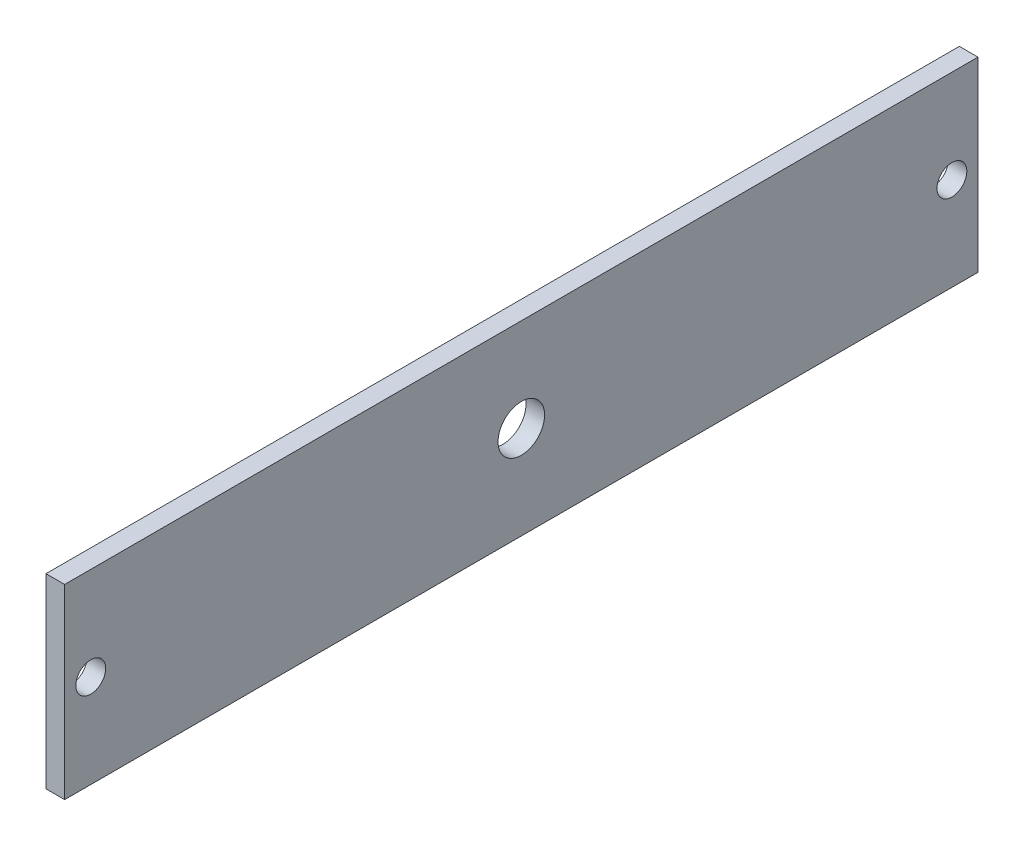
ISO-10303-21;
HEADER;
FILE_DESCRIPTION(('STEP AP214'),'2;1');
FILE_NAME('part.step','',(''),(''),'','','');
FILE_SCHEMA(('AUTOMOTIVE_DESIGN { 1 0 10303 214 1 1 1 1 }'));
ENDSEC;
DATA;
#1=APPLICATION_CONTEXT('core data for automotive mechanical design processes');
#2=APPLICATION_PROTOCOL_DEFINITION('international standard','automotive_design',2000,#1);
#3=PRODUCT_CONTEXT('',#1,'mechanical');
#4=PRODUCT('Part','Part','',(#3));
#5=PRODUCT_RELATED_PRODUCT_CATEGORY('part','',(#4));
#6=PRODUCT_DEFINITION_FORMATION('','',#4);
#7=PRODUCT_DEFINITION_CONTEXT('part definition',#1,'design');
#8=PRODUCT_DEFINITION('design','',#6,#7);
#9=PRODUCT_DEFINITION_SHAPE('','',#8);
#10=(LENGTH_UNIT() NAMED_UNIT(*) SI_UNIT(.MILLI.,.METRE.));
#11=(NAMED_UNIT(*) PLANE_ANGLE_UNIT() SI_UNIT($,.RADIAN.));
#12=(NAMED_UNIT(*) SI_UNIT($,.STERADIAN.) SOLID_ANGLE_UNIT());
#13=UNCERTAINTY_MEASURE_WITH_UNIT(LENGTH_MEASURE(1.E-05),#10,'distance_accuracy_value','');
#14=(GEOMETRIC_REPRESENTATION_CONTEXT(3) GLOBAL_UNCERTAINTY_ASSIGNED_CONTEXT((#13)) GLOBAL_UNIT_ASSIGNED_CONTEXT((#10,
#11,#12)) REPRESENTATION_CONTEXT('',''));
#15=CARTESIAN_POINT('',(0.,0.,0.));
#16=DIRECTION('',(0.,0.,1.));
#17=DIRECTION('',(1.,0.,0.));
#18=AXIS2_PLACEMENT_3D('',#15,#16,#17);
#19=CARTESIAN_POINT('',(2.54,25.4,124.46));
#20=DIRECTION('',(0.,0.,-1.));
#21=DIRECTION('',(-1.,0.,0.));
#22=AXIS2_PLACEMENT_3D('',#19,#20,#21);
#23=PLANE('',#22);
#24=DIRECTION('',(0.,-1.,0.));
#25=VECTOR('',#24,1.);
#26=CARTESIAN_POINT('',(0.,25.4,124.46));
#27=LINE('',#26,#25);
#28=CARTESIAN_POINT('',(0.,25.4,124.46));
#29=VERTEX_POINT('',#28);
#30=CARTESIAN_POINT('',(0.,0.,124.46));
#31=VERTEX_POINT('',#30);
#32=EDGE_CURVE('E99',#29,#31,#27,.T.);
#33=ORIENTED_EDGE('',*,*,#32,.T.);
#34=DIRECTION('',(-1.,0.,0.));
#35=VECTOR('',#34,1.);
#36=CARTESIAN_POINT('',(2.54,0.,124.46));
#37=LINE('',#36,#35);
#38=CARTESIAN_POINT('',(2.54,0.,124.46));
#39=VERTEX_POINT('',#38);
#40=EDGE_CURVE('E11',#39,#31,#37,.T.);
#41=ORIENTED_EDGE('',*,*,#40,.F.);
#42=DIRECTION('',(0.,-1.,0.));
#43=VECTOR('',#42,1.);
#44=CARTESIAN_POINT('',(2.54,25.4,124.46));
#45=LINE('',#44,#43);
#46=CARTESIAN_POINT('',(2.54,25.4,124.46));
#47=VERTEX_POINT('',#46);
#48=EDGE_CURVE('E87',#47,#39,#45,.T.);
#49=ORIENTED_EDGE('',*,*,#48,.F.);
#50=DIRECTION('',(-1.,0.,0.));
#51=VECTOR('',#50,1.);
#52=CARTESIAN_POINT('',(2.54,25.4,124.46));
#53=LINE('',#52,#51);
#54=EDGE_CURVE('E95',#47,#29,#53,.T.);
#55=ORIENTED_EDGE('',*,*,#54,.T.);
#56=EDGE_LOOP('',(#33,#41,#49,#55));
#57=FACE_BOUND('',#56,.T.);
#58=ADVANCED_FACE('F36',(#57),#23,.F.);
#59=CARTESIAN_POINT('',(2.54,0.,124.46));
#60=DIRECTION('',(0.,1.,0.));
#61=DIRECTION('',(0.,0.,1.));
#62=AXIS2_PLACEMENT_3D('',#59,#60,#61);
#63=PLANE('',#62);
#64=DIRECTION('',(0.,0.,-1.));
#65=VECTOR('',#64,1.);
#66=CARTESIAN_POINT('',(0.,0.,124.46));
#67=LINE('',#66,#65);
#68=CARTESIAN_POINT('',(0.,0.,0.));
#69=VERTEX_POINT('',#68);
#70=EDGE_CURVE('E91',#31,#69,#67,.T.);
#71=ORIENTED_EDGE('',*,*,#70,.T.);
#72=DIRECTION('',(-1.,0.,0.));
#73=VECTOR('',#72,1.);
#74=CARTESIAN_POINT('',(2.54,0.,0.));
#75=LINE('',#74,#73);
#76=CARTESIAN_POINT('',(2.54,0.,0.));
#77=VERTEX_POINT('',#76);
#78=EDGE_CURVE('E44',#77,#69,#75,.T.);
#79=ORIENTED_EDGE('',*,*,#78,.F.);
#80=DIRECTION('',(0.,0.,-1.));
#81=VECTOR('',#80,1.);
#82=CARTESIAN_POINT('',(2.54,0.,124.46));
#83=LINE('',#82,#81);
#84=EDGE_CURVE('E82',#39,#77,#83,.T.);
#85=ORIENTED_EDGE('',*,*,#84,.F.);
#86=ORIENTED_EDGE('',*,*,#40,.T.);
#87=EDGE_LOOP('',(#71,#79,#85,#86));
#88=FACE_BOUND('',#87,.T.);
#89=ADVANCED_FACE('F90',(#88),#63,.F.);
#90=CARTESIAN_POINT('',(2.54,25.4,0.));
#91=DIRECTION('',(0.,0.,1.));
#92=DIRECTION('',(0.,-1.,0.));
#93=AXIS2_PLACEMENT_3D('',#90,#91,#92);
#94=PLANE('',#93);
#95=DIRECTION('',(0.,1.,0.));
#96=VECTOR('',#95,1.);
#97=CARTESIAN_POINT('',(0.,25.4,0.));
#98=LINE('',#97,#96);
#99=CARTESIAN_POINT('',(0.,25.4,0.));
#100=VERTEX_POINT('',#99);
#101=EDGE_CURVE('E69',#69,#100,#98,.T.);
#102=ORIENTED_EDGE('',*,*,#101,.T.);
#103=DIRECTION('',(-1.,0.,0.));
#104=VECTOR('',#103,1.);
#105=CARTESIAN_POINT('',(2.54,25.4,0.));
#106=LINE('',#105,#104);
#107=CARTESIAN_POINT('',(2.54,25.4,0.));
#108=VERTEX_POINT('',#107);
#109=EDGE_CURVE('E92',#108,#100,#106,.T.);
#110=ORIENTED_EDGE('',*,*,#109,.F.);
#111=DIRECTION('',(0.,1.,0.));
#112=VECTOR('',#111,1.);
#113=CARTESIAN_POINT('',(2.54,25.4,0.));
#114=LINE('',#113,#112);
#115=EDGE_CURVE('E85',#77,#108,#114,.T.);
#116=ORIENTED_EDGE('',*,*,#115,.F.);
#117=ORIENTED_EDGE('',*,*,#78,.T.);
#118=EDGE_LOOP('',(#102,#110,#116,#117));
#119=FACE_BOUND('',#118,.T.);
#120=ADVANCED_FACE('F93',(#119),#94,.F.);
#121=CARTESIAN_POINT('',(2.54,25.4,124.46));
#122=DIRECTION('',(0.,-1.,0.));
#123=DIRECTION('',(0.,0.,-1.));
#124=AXIS2_PLACEMENT_3D('',#121,#122,#123);
#125=PLANE('',#124);
#126=DIRECTION('',(0.,0.,1.));
#127=VECTOR('',#126,1.);
#128=CARTESIAN_POINT('',(0.,25.4,124.46));
#129=LINE('',#128,#127);
#130=EDGE_CURVE('E75',#100,#29,#129,.T.);
#131=ORIENTED_EDGE('',*,*,#130,.T.);
#132=ORIENTED_EDGE('',*,*,#54,.F.);
#133=DIRECTION('',(0.,0.,1.));
#134=VECTOR('',#133,1.);
#135=CARTESIAN_POINT('',(2.54,25.4,124.46));
#136=LINE('',#135,#134);
#137=EDGE_CURVE('E52',#108,#47,#136,.T.);
#138=ORIENTED_EDGE('',*,*,#137,.F.);
#139=ORIENTED_EDGE('',*,*,#109,.T.);
#140=EDGE_LOOP('',(#131,#132,#138,#139));
#141=FACE_BOUND('',#140,.T.);
#142=ADVANCED_FACE('F107',(#141),#125,.F.);
#143=CARTESIAN_POINT('',(2.54,0.,0.));
#144=DIRECTION('',(1.,0.,0.));
#145=DIRECTION('',(0.,0.,-1.));
#146=AXIS2_PLACEMENT_3D('',#143,#144,#145);
#147=PLANE('',#146);
#148=CARTESIAN_POINT('',(2.54,12.7,62.23));
#149=DIRECTION('',(1.,0.,0.));
#150=DIRECTION('',(0.,0.,-1.));
#151=AXIS2_PLACEMENT_3D('',#148,#149,#150);
#152=CIRCLE('',#151,3.175);
#153=CARTESIAN_POINT('',(2.54,12.7,59.055));
#154=VERTEX_POINT('',#153);
#155=EDGE_CURVE('E125',#154,#154,#152,.T.);
#156=ORIENTED_EDGE('',*,*,#155,.F.);
#157=EDGE_LOOP('',(#156));
#158=FACE_BOUND('',#157,.T.);
#159=CARTESIAN_POINT('',(2.54,12.7,120.904));
#160=DIRECTION('',(1.,0.,0.));
#161=DIRECTION('',(0.,0.,-1.));
#162=AXIS2_PLACEMENT_3D('',#159,#160,#161);
#163=CIRCLE('',#162,2.03200000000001);
#164=CARTESIAN_POINT('',(2.54,12.7,118.872));
#165=VERTEX_POINT('',#164);
#166=EDGE_CURVE('E120',#165,#165,#163,.T.);
#167=ORIENTED_EDGE('',*,*,#166,.F.);
#168=EDGE_LOOP('',(#167));
#169=FACE_BOUND('',#168,.T.);
#170=CARTESIAN_POINT('',(2.54,12.7,3.556));
#171=DIRECTION('',(1.,0.,0.));
#172=DIRECTION('',(0.,0.,1.));
#173=AXIS2_PLACEMENT_3D('',#170,#171,#172);
#174=CIRCLE('',#173,2.03200000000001);
#175=CARTESIAN_POINT('',(2.54,12.7,5.58800000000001));
#176=VERTEX_POINT('',#175);
#177=EDGE_CURVE('E116',#176,#176,#174,.T.);
#178=ORIENTED_EDGE('',*,*,#177,.F.);
#179=EDGE_LOOP('',(#178));
#180=FACE_BOUND('',#179,.T.);
#181=ORIENTED_EDGE('',*,*,#48,.T.);
#182=ORIENTED_EDGE('',*,*,#84,.T.);
#183=ORIENTED_EDGE('',*,*,#115,.T.);
#184=ORIENTED_EDGE('',*,*,#137,.T.);
#185=EDGE_LOOP('',(#181,#182,#183,#184));
#186=FACE_BOUND('',#185,.T.);
#187=ADVANCED_FACE('F83',(#158,#169,#180,#186),#147,.T.);
#188=CARTESIAN_POINT('',(0.,0.,0.));
#189=DIRECTION('',(1.,0.,0.));
#190=DIRECTION('',(0.,0.,-1.));
#191=AXIS2_PLACEMENT_3D('',#188,#189,#190);
#192=PLANE('',#191);
#193=CARTESIAN_POINT('',(0.,12.7,62.23));
#194=DIRECTION('',(1.,0.,0.));
#195=DIRECTION('',(0.,0.,-1.));
#196=AXIS2_PLACEMENT_3D('',#193,#194,#195);
#197=CIRCLE('',#196,3.175);
#198=CARTESIAN_POINT('',(0.,12.7,59.055));
#199=VERTEX_POINT('',#198);
#200=EDGE_CURVE('E117',#199,#199,#197,.T.);
#201=ORIENTED_EDGE('',*,*,#200,.T.);
#202=EDGE_LOOP('',(#201));
#203=FACE_BOUND('',#202,.T.);
#204=CARTESIAN_POINT('',(0.,12.7,120.904));
#205=DIRECTION('',(1.,0.,0.));
#206=DIRECTION('',(0.,0.,-1.));
#207=AXIS2_PLACEMENT_3D('',#204,#205,#206);
#208=CIRCLE('',#207,2.03200000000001);
#209=CARTESIAN_POINT('',(0.,12.7,118.872));
#210=VERTEX_POINT('',#209);
#211=EDGE_CURVE('E102',#210,#210,#208,.T.);
#212=ORIENTED_EDGE('',*,*,#211,.T.);
#213=EDGE_LOOP('',(#212));
#214=FACE_BOUND('',#213,.T.);
#215=CARTESIAN_POINT('',(0.,12.7,3.556));
#216=DIRECTION('',(1.,0.,0.));
#217=DIRECTION('',(0.,0.,1.));
#218=AXIS2_PLACEMENT_3D('',#215,#216,#217);
#219=CIRCLE('',#218,2.03200000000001);
#220=CARTESIAN_POINT('',(0.,12.7,5.58800000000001));
#221=VERTEX_POINT('',#220);
#222=EDGE_CURVE('E113',#221,#221,#219,.T.);
#223=ORIENTED_EDGE('',*,*,#222,.T.);
#224=EDGE_LOOP('',(#223));
#225=FACE_BOUND('',#224,.T.);
#226=ORIENTED_EDGE('',*,*,#32,.F.);
#227=ORIENTED_EDGE('',*,*,#130,.F.);
#228=ORIENTED_EDGE('',*,*,#101,.F.);
#229=ORIENTED_EDGE('',*,*,#70,.F.);
#230=EDGE_LOOP('',(#226,#227,#228,#229));
#231=FACE_BOUND('',#230,.T.);
#232=ADVANCED_FACE('F110',(#203,#214,#225,#231),#192,.F.);
#233=CARTESIAN_POINT('',(0.,12.7,3.556));
#234=DIRECTION('',(1.,0.,0.));
#235=DIRECTION('',(0.,0.,-1.));
#236=AXIS2_PLACEMENT_3D('',#233,#234,#235);
#237=CYLINDRICAL_SURFACE('',#236,2.03200000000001);
#238=ORIENTED_EDGE('',*,*,#222,.F.);
#239=EDGE_LOOP('',(#238));
#240=FACE_BOUND('',#239,.T.);
#241=ORIENTED_EDGE('',*,*,#177,.T.);
#242=EDGE_LOOP('',(#241));
#243=FACE_BOUND('',#242,.T.);
#244=ADVANCED_FACE('F147',(#240,#243),#237,.F.);
#245=CARTESIAN_POINT('',(0.,12.7,120.904));
#246=DIRECTION('',(1.,0.,0.));
#247=DIRECTION('',(0.,0.,-1.));
#248=AXIS2_PLACEMENT_3D('',#245,#246,#247);
#249=CYLINDRICAL_SURFACE('',#248,2.03200000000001);
#250=ORIENTED_EDGE('',*,*,#211,.F.);
#251=EDGE_LOOP('',(#250));
#252=FACE_BOUND('',#251,.T.);
#253=ORIENTED_EDGE('',*,*,#166,.T.);
#254=EDGE_LOOP('',(#253));
#255=FACE_BOUND('',#254,.T.);
#256=ADVANCED_FACE('F136',(#252,#255),#249,.F.);
#257=CARTESIAN_POINT('',(0.,12.7,62.23));
#258=DIRECTION('',(1.,0.,0.));
#259=DIRECTION('',(0.,0.,-1.));
#260=AXIS2_PLACEMENT_3D('',#257,#258,#259);
#261=CYLINDRICAL_SURFACE('',#260,3.175);
#262=ORIENTED_EDGE('',*,*,#200,.F.);
#263=EDGE_LOOP('',(#262));
#264=FACE_BOUND('',#263,.T.);
#265=ORIENTED_EDGE('',*,*,#155,.T.);
#266=EDGE_LOOP('',(#265));
#267=FACE_BOUND('',#266,.T.);
#268=ADVANCED_FACE('F133',(#264,#267),#261,.F.);
#269=CLOSED_SHELL('',(#58,#89,#120,#142,#187,#232,#244,#256,#268));
#270=MANIFOLD_SOLID_BREP('B2',#269);
#271=ADVANCED_BREP_SHAPE_REPRESENTATION('',(#18,#270),#14);
#272=SHAPE_DEFINITION_REPRESENTATION(#9,#271);
ENDSEC;
END-ISO-10303-21;
